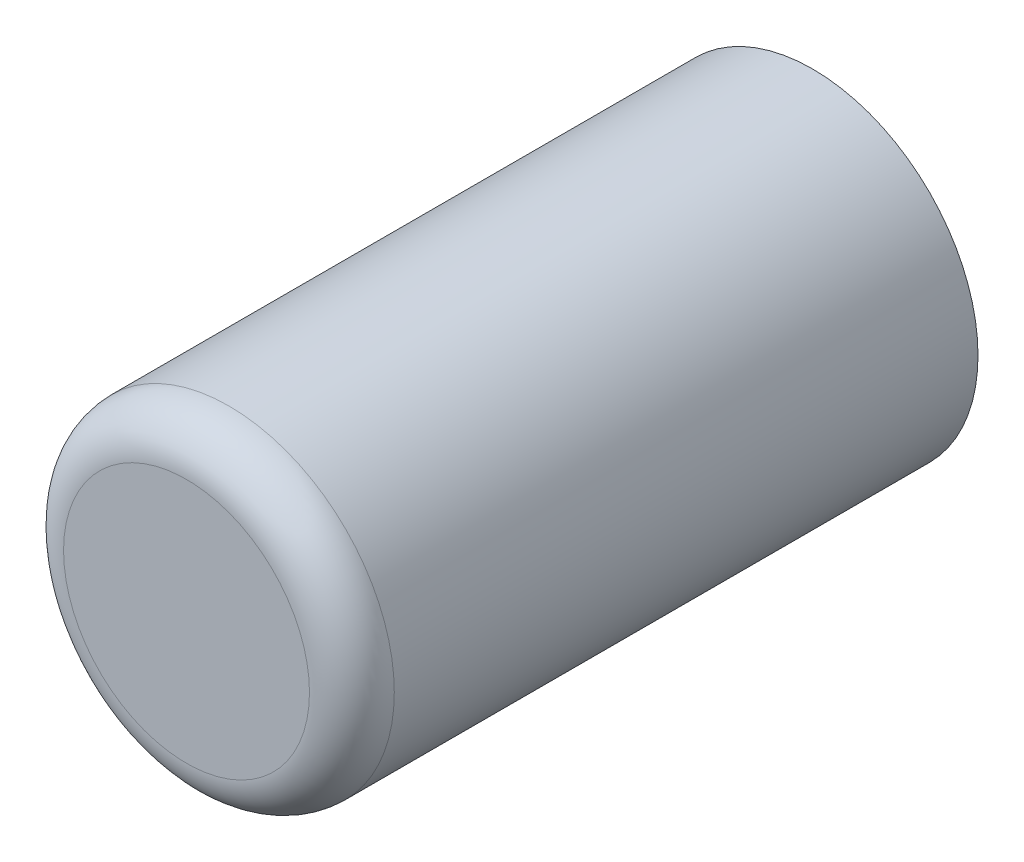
from build123d import *

# Parameters (mm, degrees)
SKETCH1_R           = 11.696902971
BOSS_EXTRUDE1_DEPTH = 44.286855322
FILLET1_R           = 3


with BuildPart() as part:
    # Sketch1 → Boss-Extrude1 (new body)
    with BuildSketch(Plane.XY):
        with Locations((-22.5, 239.519273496)):
            Circle(SKETCH1_R)
    extrude(amount=BOSS_EXTRUDE1_DEPTH)

    # Fillet1
    fillet1_edges = [part.edges().sort_by_distance(p)[0] for p in [
        (-34.196902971, 239.519273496, 44.286855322),
    ]]
    fillet(fillet1_edges, radius=FILLET1_R)


solid = part.part
